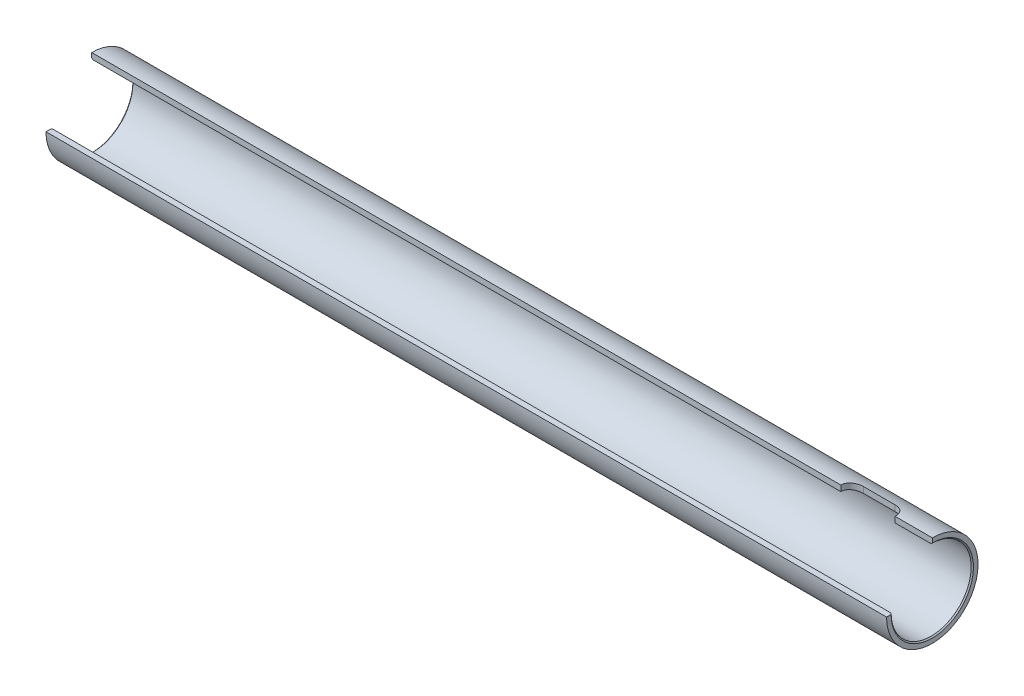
ISO-10303-21;
HEADER;
FILE_DESCRIPTION(('STEP AP214'),'2;1');
FILE_NAME('part.step','',(''),(''),'','','');
FILE_SCHEMA(('AUTOMOTIVE_DESIGN { 1 0 10303 214 1 1 1 1 }'));
ENDSEC;
DATA;
#1=APPLICATION_CONTEXT('core data for automotive mechanical design processes');
#2=APPLICATION_PROTOCOL_DEFINITION('international standard','automotive_design',2000,#1);
#3=PRODUCT_CONTEXT('',#1,'mechanical');
#4=PRODUCT('Part','Part','',(#3));
#5=PRODUCT_RELATED_PRODUCT_CATEGORY('part','',(#4));
#6=PRODUCT_DEFINITION_FORMATION('','',#4);
#7=PRODUCT_DEFINITION_CONTEXT('part definition',#1,'design');
#8=PRODUCT_DEFINITION('design','',#6,#7);
#9=PRODUCT_DEFINITION_SHAPE('','',#8);
#10=(LENGTH_UNIT() NAMED_UNIT(*) SI_UNIT(.MILLI.,.METRE.));
#11=(NAMED_UNIT(*) PLANE_ANGLE_UNIT() SI_UNIT($,.RADIAN.));
#12=(NAMED_UNIT(*) SI_UNIT($,.STERADIAN.) SOLID_ANGLE_UNIT());
#13=UNCERTAINTY_MEASURE_WITH_UNIT(LENGTH_MEASURE(1.E-05),#10,'distance_accuracy_value','');
#14=(GEOMETRIC_REPRESENTATION_CONTEXT(3) GLOBAL_UNCERTAINTY_ASSIGNED_CONTEXT((#13)) GLOBAL_UNIT_ASSIGNED_CONTEXT((#10,
#11,#12)) REPRESENTATION_CONTEXT('',''));
#15=CARTESIAN_POINT('',(0.,0.,0.));
#16=DIRECTION('',(0.,0.,1.));
#17=DIRECTION('',(1.,0.,0.));
#18=AXIS2_PLACEMENT_3D('',#15,#16,#17);
#19=CARTESIAN_POINT('',(-147.,0.,0.));
#20=DIRECTION('',(1.,0.,0.));
#21=DIRECTION('',(0.,0.,-1.));
#22=AXIS2_PLACEMENT_3D('',#19,#20,#21);
#23=CYLINDRICAL_SURFACE('',#22,8.);
#24=DIRECTION('',(1.,0.,0.));
#25=VECTOR('',#24,1.);
#26=CARTESIAN_POINT('',(-147.001,0.,8.));
#27=LINE('',#26,#25);
#28=CARTESIAN_POINT('',(-147.,0.,8.));
#29=VERTEX_POINT('',#28);
#30=CARTESIAN_POINT('',(0.,0.,8.));
#31=VERTEX_POINT('',#30);
#32=EDGE_CURVE('E201',#29,#31,#27,.T.);
#33=ORIENTED_EDGE('',*,*,#32,.F.);
#34=CARTESIAN_POINT('',(-147.,0.,0.));
#35=DIRECTION('',(1.,0.,0.));
#36=DIRECTION('',(0.,0.,-1.));
#37=AXIS2_PLACEMENT_3D('',#34,#35,#36);
#38=CIRCLE('',#37,8.);
#39=CARTESIAN_POINT('',(-147.,8.,0.));
#40=VERTEX_POINT('',#39);
#41=EDGE_CURVE('E185',#29,#40,#38,.T.);
#42=ORIENTED_EDGE('',*,*,#41,.T.);
#43=DIRECTION('',(1.,0.,0.));
#44=VECTOR('',#43,1.);
#45=CARTESIAN_POINT('',(-147.001,8.,0.));
#46=LINE('',#45,#44);
#47=CARTESIAN_POINT('',(-16.,8.,0.));
#48=VERTEX_POINT('',#47);
#49=EDGE_CURVE('E206',#40,#48,#46,.T.);
#50=ORIENTED_EDGE('',*,*,#49,.T.);
#51=CARTESIAN_POINT('',(-14.,7.74596669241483,-2.));
#52=CARTESIAN_POINT('',(-14.0553259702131,7.74596297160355,-2.00000067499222));
#53=CARTESIAN_POINT('',(-14.1106245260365,7.74656019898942,-1.99770281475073));
#54=CARTESIAN_POINT('',(-14.2208080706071,7.74891809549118,-1.98854259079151));
#55=CARTESIAN_POINT('',(-14.2756931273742,7.75067856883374,-1.98168099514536));
#56=CARTESIAN_POINT('',(-14.4389063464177,7.75763421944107,-1.95435047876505));
#57=CARTESIAN_POINT('',(-14.5461129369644,7.76450406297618,-1.92713539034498));
#58=CARTESIAN_POINT('',(-14.7542493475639,7.78190845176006,-1.85559615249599));
#59=CARTESIAN_POINT('',(-14.8551797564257,7.7924426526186,-1.81127361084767));
#60=CARTESIAN_POINT('',(-15.0482228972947,7.81598268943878,-1.70683075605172));
#61=CARTESIAN_POINT('',(-15.1403332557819,7.82898918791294,-1.64670620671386));
#62=CARTESIAN_POINT('',(-15.3150877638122,7.8563252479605,-1.51096894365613));
#63=CARTESIAN_POINT('',(-15.3975097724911,7.87067582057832,-1.43507453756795));
#64=CARTESIAN_POINT('',(-15.5486041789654,7.89890208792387,-1.27055156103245));
#65=CARTESIAN_POINT('',(-15.6172743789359,7.91277770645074,-1.18192095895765));
#66=CARTESIAN_POINT('',(-15.7398220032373,7.93872364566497,-0.992913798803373));
#67=CARTESIAN_POINT('',(-15.793479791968,7.95076609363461,-0.892390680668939));
#68=CARTESIAN_POINT('',(-15.8830494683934,7.97144692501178,-0.683405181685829));
#69=CARTESIAN_POINT('',(-15.9189648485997,7.98008597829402,-0.574944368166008));
#70=CARTESIAN_POINT('',(-15.9713179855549,7.99283800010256,-0.355488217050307));
#71=CARTESIAN_POINT('',(-15.9881353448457,7.99703905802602,-0.244588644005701));
#72=CARTESIAN_POINT('',(-16.0030067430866,8.00074876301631,-0.0214655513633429));
#73=CARTESIAN_POINT('',(-16.0010631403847,8.00025799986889,0.0907578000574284));
#74=CARTESIAN_POINT('',(-15.9787400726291,7.99470474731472,0.310704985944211));
#75=CARTESIAN_POINT('',(-15.9587707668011,7.98974397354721,0.418473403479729));
#76=CARTESIAN_POINT('',(-15.9016226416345,7.97592661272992,0.6290774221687));
#77=CARTESIAN_POINT('',(-15.8644430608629,7.96706985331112,0.731912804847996));
#78=CARTESIAN_POINT('',(-15.7735974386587,7.94629995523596,0.9308145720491));
#79=CARTESIAN_POINT('',(-15.7197852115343,7.93435987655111,1.02681125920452));
#80=CARTESIAN_POINT('',(-15.5973137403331,7.90871891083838,1.20855326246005));
#81=CARTESIAN_POINT('',(-15.5286522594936,7.89501775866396,1.2942970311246));
#82=CARTESIAN_POINT('',(-15.3762421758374,7.8669113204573,1.45553877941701));
#83=CARTESIAN_POINT('',(-15.2921367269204,7.8524970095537,1.53069820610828));
#84=CARTESIAN_POINT('',(-15.1123402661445,7.82492336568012,1.6659391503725));
#85=CARTESIAN_POINT('',(-15.0166460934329,7.81176437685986,1.72601654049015));
#86=CARTESIAN_POINT('',(-14.8157088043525,7.7881562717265,1.82960941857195));
#87=CARTESIAN_POINT('',(-14.7104170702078,7.77772212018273,1.87303403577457));
#88=CARTESIAN_POINT('',(-14.4937661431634,7.76094117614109,1.94140470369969));
#89=CARTESIAN_POINT('',(-14.3824162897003,7.7545882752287,1.96637837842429));
#90=CARTESIAN_POINT('',(-14.2250852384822,7.74910581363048,1.98780927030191));
#91=CARTESIAN_POINT('',(-14.1801605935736,7.74793046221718,1.99238158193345));
#92=CARTESIAN_POINT('',(-14.0901644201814,7.74636124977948,1.99847351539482));
#93=CARTESIAN_POINT('',(-14.0450932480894,7.74596612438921,1.99999807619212));
#94=CARTESIAN_POINT('',(-14.,7.74596669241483,2.00000000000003));
#95=B_SPLINE_CURVE_WITH_KNOTS('',3,(#51,#52,#53,#54,#55,#56,#57,#58,#59,#60,#61,#62,#63,#64,#65,
#66,#67,#68,#69,#70,#71,#72,#73,#74,#75,#76,#77,#78,#79,#80,#81,#82,#83,#84,#85,#86,#87,#88,#89,
#90,#91,#92,#93,#94),.UNSPECIFIED.,.F.,.F.,(4,2,2,2,2,2,2,2,2,2,2,2,2,2,2,2,2,2,2,2,2,4),(0.,
0.165873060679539,0.331718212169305,0.662459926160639,0.993170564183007,1.32396994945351,
1.66128379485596,1.9986515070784,2.34072374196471,2.68272861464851,3.01780963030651,
3.3528485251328,3.68045090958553,4.00806778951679,4.33865018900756,4.6692824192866,
5.00882859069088,5.34846758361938,5.68993440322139,6.03088895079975,6.166316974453,
6.30152535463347),.UNSPECIFIED.);
#96=CARTESIAN_POINT('',(-14.,7.74596669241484,-1.99999999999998));
#97=VERTEX_POINT('',#96);
#98=EDGE_CURVE('E163',#97,#48,#95,.T.);
#99=ORIENTED_EDGE('',*,*,#98,.F.);
#100=DIRECTION('',(1.,0.,0.));
#101=VECTOR('',#100,1.);
#102=CARTESIAN_POINT('',(-147.,7.74596669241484,-1.99999999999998));
#103=LINE('',#102,#101);
#104=CARTESIAN_POINT('',(-8.50000000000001,7.74596669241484,-1.99999999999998));
#105=VERTEX_POINT('',#104);
#106=EDGE_CURVE('E171',#105,#97,#103,.F.);
#107=ORIENTED_EDGE('',*,*,#106,.F.);
#108=CARTESIAN_POINT('',(-8.5,7.74596669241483,2.00000000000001));
#109=CARTESIAN_POINT('',(-8.44467402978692,7.74596297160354,2.00000067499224));
#110=CARTESIAN_POINT('',(-8.38937547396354,7.74656019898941,1.99770281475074));
#111=CARTESIAN_POINT('',(-8.27919192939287,7.74891809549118,1.98854259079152));
#112=CARTESIAN_POINT('',(-8.22430687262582,7.75067856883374,1.98168099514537));
#113=CARTESIAN_POINT('',(-8.06109365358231,7.75763421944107,1.95435047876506));
#114=CARTESIAN_POINT('',(-7.95388706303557,7.76450406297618,1.927135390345));
#115=CARTESIAN_POINT('',(-7.74575065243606,7.78190845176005,1.855596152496));
#116=CARTESIAN_POINT('',(-7.64482024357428,7.7924426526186,1.81127361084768));
#117=CARTESIAN_POINT('',(-7.45177710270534,7.81598268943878,1.70683075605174));
#118=CARTESIAN_POINT('',(-7.35966674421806,7.82898918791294,1.64670620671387));
#119=CARTESIAN_POINT('',(-7.18491223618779,7.8563252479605,1.51096894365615));
#120=CARTESIAN_POINT('',(-7.10249022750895,7.87067582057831,1.43507453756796));
#121=CARTESIAN_POINT('',(-6.95139582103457,7.89890208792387,1.27055156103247));
#122=CARTESIAN_POINT('',(-6.8827256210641,7.91277770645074,1.18192095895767));
#123=CARTESIAN_POINT('',(-6.7601779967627,7.93872364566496,0.992913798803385));
#124=CARTESIAN_POINT('',(-6.70652020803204,7.95076609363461,0.892390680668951));
#125=CARTESIAN_POINT('',(-6.61695053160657,7.97144692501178,0.68340518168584));
#126=CARTESIAN_POINT('',(-6.58103515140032,7.98008597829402,0.57494436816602));
#127=CARTESIAN_POINT('',(-6.52868201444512,7.99283800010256,0.355488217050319));
#128=CARTESIAN_POINT('',(-6.51186465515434,7.99703905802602,0.244588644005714));
#129=CARTESIAN_POINT('',(-6.49699325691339,8.00074876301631,0.0214655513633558));
#130=CARTESIAN_POINT('',(-6.49893685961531,8.00025799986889,-0.0907578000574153));
#131=CARTESIAN_POINT('',(-6.52125992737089,7.99470474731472,-0.310704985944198));
#132=CARTESIAN_POINT('',(-6.54122923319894,7.98974397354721,-0.418473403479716));
#133=CARTESIAN_POINT('',(-6.59837735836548,7.97592661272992,-0.629077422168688));
#134=CARTESIAN_POINT('',(-6.63555693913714,7.96706985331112,-0.731912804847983));
#135=CARTESIAN_POINT('',(-6.72640256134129,7.94629995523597,-0.930814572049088));
#136=CARTESIAN_POINT('',(-6.78021478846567,7.93435987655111,-1.02681125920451));
#137=CARTESIAN_POINT('',(-6.90268625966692,7.90871891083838,-1.20855326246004));
#138=CARTESIAN_POINT('',(-6.97134774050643,7.89501775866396,-1.29429703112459));
#139=CARTESIAN_POINT('',(-7.12375782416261,7.86691132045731,-1.45553877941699));
#140=CARTESIAN_POINT('',(-7.20786327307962,7.85249700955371,-1.53069820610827));
#141=CARTESIAN_POINT('',(-7.38765973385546,7.82492336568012,-1.66593915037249));
#142=CARTESIAN_POINT('',(-7.48335390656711,7.81176437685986,-1.72601654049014));
#143=CARTESIAN_POINT('',(-7.68429119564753,7.7881562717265,-1.82960941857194));
#144=CARTESIAN_POINT('',(-7.78958292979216,7.77772212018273,-1.87303403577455));
#145=CARTESIAN_POINT('',(-8.00623385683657,7.7609411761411,-1.94140470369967));
#146=CARTESIAN_POINT('',(-8.11758371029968,7.7545882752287,-1.96637837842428));
#147=CARTESIAN_POINT('',(-8.2749147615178,7.74910581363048,-1.98780927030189));
#148=CARTESIAN_POINT('',(-8.31983940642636,7.74793046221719,-1.99238158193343));
#149=CARTESIAN_POINT('',(-8.40983557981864,7.74636124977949,-1.9984735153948));
#150=CARTESIAN_POINT('',(-8.45490675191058,7.74596612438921,-1.99999807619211));
#151=CARTESIAN_POINT('',(-8.5,7.74596669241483,-2.00000000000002));
#152=B_SPLINE_CURVE_WITH_KNOTS('',3,(#108,#109,#110,#111,#112,#113,#114,#115,#116,#117,#118,
#119,#120,#121,#122,#123,#124,#125,#126,#127,#128,#129,#130,#131,#132,#133,#134,#135,#136,#137,
#138,#139,#140,#141,#142,#143,#144,#145,#146,#147,#148,#149,#150,#151),.UNSPECIFIED.,.F.,.F.,(4,
2,2,2,2,2,2,2,2,2,2,2,2,2,2,2,2,2,2,2,2,4),(0.,0.16587306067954,0.331718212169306,
0.662459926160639,0.993170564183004,1.32396994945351,1.66128379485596,1.9986515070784,
2.34072374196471,2.68272861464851,3.01780963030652,3.3528485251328,3.68045090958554,
4.00806778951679,4.33865018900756,4.66928241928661,5.00882859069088,5.34846758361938,
5.68993440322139,6.03088895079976,6.166316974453,6.30152535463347),.UNSPECIFIED.);
#153=CARTESIAN_POINT('',(-6.49999999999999,8.,0.));
#154=VERTEX_POINT('',#153);
#155=EDGE_CURVE('E170',#154,#105,#152,.T.);
#156=ORIENTED_EDGE('',*,*,#155,.F.);
#157=CARTESIAN_POINT('',(0.,8.,0.));
#158=VERTEX_POINT('',#157);
#159=EDGE_CURVE('E225',#154,#158,#46,.T.);
#160=ORIENTED_EDGE('',*,*,#159,.T.);
#161=CARTESIAN_POINT('',(0.,0.,0.));
#162=DIRECTION('',(1.,0.,0.));
#163=DIRECTION('',(0.,0.,-1.));
#164=AXIS2_PLACEMENT_3D('',#161,#162,#163);
#165=CIRCLE('',#164,8.);
#166=EDGE_CURVE('E189',#31,#158,#165,.T.);
#167=ORIENTED_EDGE('',*,*,#166,.F.);
#168=EDGE_LOOP('',(#33,#42,#50,#99,#107,#156,#160,#167));
#169=FACE_BOUND('',#168,.T.);
#170=ADVANCED_FACE('F33',(#169),#23,.T.);
#171=CARTESIAN_POINT('',(-147.,0.,0.));
#172=DIRECTION('',(1.,0.,0.));
#173=DIRECTION('',(0.,0.,-1.));
#174=AXIS2_PLACEMENT_3D('',#171,#172,#173);
#175=CYLINDRICAL_SURFACE('',#174,7.);
#176=CARTESIAN_POINT('',(-146.8,0.,0.));
#177=DIRECTION('',(1.,0.,0.));
#178=DIRECTION('',(0.,0.,-1.));
#179=AXIS2_PLACEMENT_3D('',#176,#177,#178);
#180=CIRCLE('',#179,7.);
#181=CARTESIAN_POINT('',(-146.8,7.,0.));
#182=VERTEX_POINT('',#181);
#183=CARTESIAN_POINT('',(-146.8,0.,7.));
#184=VERTEX_POINT('',#183);
#185=EDGE_CURVE('E41',#182,#184,#180,.F.);
#186=ORIENTED_EDGE('',*,*,#185,.T.);
#187=DIRECTION('',(1.,0.,0.));
#188=VECTOR('',#187,1.);
#189=CARTESIAN_POINT('',(-147.,0.,7.));
#190=LINE('',#189,#188);
#191=CARTESIAN_POINT('',(-0.200000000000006,0.,7.));
#192=VERTEX_POINT('',#191);
#193=EDGE_CURVE('E112',#192,#184,#190,.F.);
#194=ORIENTED_EDGE('',*,*,#193,.F.);
#195=CARTESIAN_POINT('',(-0.200000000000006,0.,0.));
#196=DIRECTION('',(1.,0.,0.));
#197=DIRECTION('',(0.,0.,-1.));
#198=AXIS2_PLACEMENT_3D('',#195,#196,#197);
#199=CIRCLE('',#198,7.);
#200=CARTESIAN_POINT('',(-0.200000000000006,7.,0.));
#201=VERTEX_POINT('',#200);
#202=EDGE_CURVE('E126',#192,#201,#199,.T.);
#203=ORIENTED_EDGE('',*,*,#202,.T.);
#204=DIRECTION('',(1.,0.,0.));
#205=VECTOR('',#204,1.);
#206=CARTESIAN_POINT('',(-147.,7.,0.));
#207=LINE('',#206,#205);
#208=CARTESIAN_POINT('',(-6.49999999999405,7.0000000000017,6.2615564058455E-13));
#209=VERTEX_POINT('',#208);
#210=EDGE_CURVE('E56',#209,#201,#207,.T.);
#211=ORIENTED_EDGE('',*,*,#210,.F.);
#212=CARTESIAN_POINT('',(-8.5,6.70820393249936,-2.00000000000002));
#213=CARTESIAN_POINT('',(-8.44496595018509,6.70819953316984,-2.00000099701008));
#214=CARTESIAN_POINT('',(-8.38995948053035,6.70888204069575,-1.99772698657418));
#215=CARTESIAN_POINT('',(-8.28036379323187,6.71157572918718,-1.98866401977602));
#216=CARTESIAN_POINT('',(-8.2257744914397,6.71358663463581,-1.98187599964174));
#217=CARTESIAN_POINT('',(-8.06349250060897,6.72152750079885,-1.95485062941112));
#218=CARTESIAN_POINT('',(-7.95692436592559,6.72936619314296,-1.92795143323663));
#219=CARTESIAN_POINT('',(-7.75005997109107,6.74920530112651,-1.85729763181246));
#220=CARTESIAN_POINT('',(-7.64976201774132,6.76120458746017,-1.8135476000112));
#221=CARTESIAN_POINT('',(-7.45786335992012,6.78800504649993,-1.71050096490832));
#222=CARTESIAN_POINT('',(-7.36626620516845,6.80280735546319,-1.65119805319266));
#223=CARTESIAN_POINT('',(-7.19180923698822,6.83401742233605,-1.51692637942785));
#224=CARTESIAN_POINT('',(-7.10923586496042,6.85045675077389,-1.44159286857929));
#225=CARTESIAN_POINT('',(-6.95770094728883,6.88281888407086,-1.27817556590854));
#226=CARTESIAN_POINT('',(-6.88874165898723,6.89874160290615,-1.1900896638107));
#227=CARTESIAN_POINT('',(-6.7651698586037,6.92863365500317,-1.00164390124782));
#228=CARTESIAN_POINT('',(-6.71084792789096,6.94256116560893,-0.901086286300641));
#229=CARTESIAN_POINT('',(-6.61999661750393,6.96652585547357,-0.691803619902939));
#230=CARTESIAN_POINT('',(-6.58346298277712,6.9765639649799,-0.583080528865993));
#231=CARTESIAN_POINT('',(-6.53016581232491,6.99139511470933,-0.363559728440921));
#232=CARTESIAN_POINT('',(-6.51291134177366,6.9963181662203,-0.252890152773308));
#233=CARTESIAN_POINT('',(-6.4971132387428,7.0008209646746,-0.0301224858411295));
#234=CARTESIAN_POINT('',(-6.4985664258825,7.00040161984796,0.0819753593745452));
#235=CARTESIAN_POINT('',(-6.51980642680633,6.99436005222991,0.300980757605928));
#236=CARTESIAN_POINT('',(-6.53906180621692,6.98888865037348,0.407944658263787));
#237=CARTESIAN_POINT('',(-6.59449548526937,6.97353876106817,0.617053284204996));
#238=CARTESIAN_POINT('',(-6.63067463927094,6.96366005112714,0.719197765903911));
#239=CARTESIAN_POINT('',(-6.7193097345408,6.94039022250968,0.917074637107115));
#240=CARTESIAN_POINT('',(-6.77193952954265,6.92696183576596,1.01272458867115));
#241=CARTESIAN_POINT('',(-6.89184578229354,6.89802743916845,1.19400864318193));
#242=CARTESIAN_POINT('',(-6.95912521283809,6.88252100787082,1.27964070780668));
#243=CARTESIAN_POINT('',(-7.10919759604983,6.85045847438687,1.44162429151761));
#244=CARTESIAN_POINT('',(-7.1924510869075,6.83388462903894,1.51754611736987));
#245=CARTESIAN_POINT('',(-7.37069729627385,6.8020328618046,1.65448071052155));
#246=CARTESIAN_POINT('',(-7.46569333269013,6.78675530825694,1.71548924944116));
#247=CARTESIAN_POINT('',(-7.66578722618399,6.75914312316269,1.82126577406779));
#248=CARTESIAN_POINT('',(-7.77096410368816,6.74683461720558,1.86589126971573));
#249=CARTESIAN_POINT('',(-7.98771206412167,6.72687625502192,1.93662306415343));
#250=CARTESIAN_POINT('',(-8.0992731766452,6.71921934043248,1.96275743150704));
#251=CARTESIAN_POINT('',(-8.25987946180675,6.71232934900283,1.98612021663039));
#252=CARTESIAN_POINT('',(-8.307779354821,6.71078540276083,1.99132502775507));
#253=CARTESIAN_POINT('',(-8.4037782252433,6.70872274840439,1.99826154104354));
#254=CARTESIAN_POINT('',(-8.45187678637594,6.70820247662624,1.9999985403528));
#255=CARTESIAN_POINT('',(-8.5,6.70820393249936,2.00000000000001));
#256=B_SPLINE_CURVE_WITH_KNOTS('',3,(#212,#213,#214,#215,#216,#217,#218,#219,#220,#221,#222,
#223,#224,#225,#226,#227,#228,#229,#230,#231,#232,#233,#234,#235,#236,#237,#238,#239,#240,#241,
#242,#243,#244,#245,#246,#247,#248,#249,#250,#251,#252,#253,#254,#255),.UNSPECIFIED.,.F.,.F.,(4,
2,2,2,2,2,2,2,2,2,2,2,2,2,2,2,2,2,2,2,2,4),(0.,0.164996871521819,0.329959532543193,
0.658815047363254,0.987581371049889,1.31648125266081,1.6538679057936,1.99131045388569,
2.33502692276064,2.67866113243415,3.01332990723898,3.34794178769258,3.67287650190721,
3.99782762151,4.32633613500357,4.65491137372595,4.99498620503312,5.33515734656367,
5.67822068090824,6.02076213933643,6.16526974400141,6.30955644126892),.UNSPECIFIED.);
#257=CARTESIAN_POINT('',(-8.5,6.70820393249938,-2.00000000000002));
#258=VERTEX_POINT('',#257);
#259=EDGE_CURVE('E143',#258,#209,#256,.T.);
#260=ORIENTED_EDGE('',*,*,#259,.F.);
#261=DIRECTION('',(1.,0.,0.));
#262=VECTOR('',#261,1.);
#263=CARTESIAN_POINT('',(-147.,6.70820393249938,-1.99999999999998));
#264=LINE('',#263,#262);
#265=CARTESIAN_POINT('',(-14.,6.70820393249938,-1.99999999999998));
#266=VERTEX_POINT('',#265);
#267=EDGE_CURVE('E188',#266,#258,#264,.T.);
#268=ORIENTED_EDGE('',*,*,#267,.F.);
#269=CARTESIAN_POINT('',(-14.,6.70820393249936,2.00000000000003));
#270=CARTESIAN_POINT('',(-14.0550340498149,6.70819953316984,2.00000099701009));
#271=CARTESIAN_POINT('',(-14.1100405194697,6.70888204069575,1.99772698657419));
#272=CARTESIAN_POINT('',(-14.2196362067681,6.71157572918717,1.98866401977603));
#273=CARTESIAN_POINT('',(-14.2742255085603,6.7135866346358,1.98187599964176));
#274=CARTESIAN_POINT('',(-14.436507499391,6.72152750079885,1.95485062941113));
#275=CARTESIAN_POINT('',(-14.5430756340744,6.72936619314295,1.92795143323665));
#276=CARTESIAN_POINT('',(-14.7499400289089,6.74920530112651,1.85729763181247));
#277=CARTESIAN_POINT('',(-14.8502379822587,6.76120458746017,1.81354760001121));
#278=CARTESIAN_POINT('',(-15.0421366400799,6.78800504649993,1.71050096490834));
#279=CARTESIAN_POINT('',(-15.1337337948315,6.80280735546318,1.65119805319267));
#280=CARTESIAN_POINT('',(-15.3081907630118,6.83401742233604,1.51692637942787));
#281=CARTESIAN_POINT('',(-15.3907641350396,6.85045675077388,1.4415928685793));
#282=CARTESIAN_POINT('',(-15.5422990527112,6.88281888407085,1.27817556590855));
#283=CARTESIAN_POINT('',(-15.6112583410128,6.89874160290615,1.19008966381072));
#284=CARTESIAN_POINT('',(-15.7348301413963,6.92863365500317,1.00164390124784));
#285=CARTESIAN_POINT('',(-15.789152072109,6.94256116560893,0.901086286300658));
#286=CARTESIAN_POINT('',(-15.8800033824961,6.96652585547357,0.691803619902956));
#287=CARTESIAN_POINT('',(-15.9165370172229,6.9765639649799,0.583080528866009));
#288=CARTESIAN_POINT('',(-15.9698341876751,6.99139511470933,0.363559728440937));
#289=CARTESIAN_POINT('',(-15.9870886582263,6.99631816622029,0.252890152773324));
#290=CARTESIAN_POINT('',(-16.0028867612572,7.0008209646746,0.0301224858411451));
#291=CARTESIAN_POINT('',(-16.0014335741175,7.00040161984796,-0.0819753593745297));
#292=CARTESIAN_POINT('',(-15.9801935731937,6.99436005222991,-0.300980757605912));
#293=CARTESIAN_POINT('',(-15.9609381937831,6.98888865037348,-0.407944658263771));
#294=CARTESIAN_POINT('',(-15.9055045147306,6.97353876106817,-0.61705328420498));
#295=CARTESIAN_POINT('',(-15.8693253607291,6.96366005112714,-0.719197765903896));
#296=CARTESIAN_POINT('',(-15.7806902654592,6.94039022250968,-0.9170746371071));
#297=CARTESIAN_POINT('',(-15.7280604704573,6.92696183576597,-1.01272458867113));
#298=CARTESIAN_POINT('',(-15.6081542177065,6.89802743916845,-1.19400864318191));
#299=CARTESIAN_POINT('',(-15.5408747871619,6.88252100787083,-1.27964070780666));
#300=CARTESIAN_POINT('',(-15.3908024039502,6.85045847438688,-1.4416242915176));
#301=CARTESIAN_POINT('',(-15.3075489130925,6.83388462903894,-1.51754611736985));
#302=CARTESIAN_POINT('',(-15.1293027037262,6.8020328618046,-1.65448071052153));
#303=CARTESIAN_POINT('',(-15.0343066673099,6.78675530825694,-1.71548924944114));
#304=CARTESIAN_POINT('',(-14.834212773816,6.75914312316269,-1.82126577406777));
#305=CARTESIAN_POINT('',(-14.7290358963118,6.74683461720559,-1.86589126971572));
#306=CARTESIAN_POINT('',(-14.5122879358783,6.72687625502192,-1.93662306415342));
#307=CARTESIAN_POINT('',(-14.4007268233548,6.71921934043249,-1.96275743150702));
#308=CARTESIAN_POINT('',(-14.2401205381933,6.71232934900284,-1.98612021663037));
#309=CARTESIAN_POINT('',(-14.192220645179,6.71078540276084,-1.99132502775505));
#310=CARTESIAN_POINT('',(-14.0962217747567,6.7087227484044,-1.99826154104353));
#311=CARTESIAN_POINT('',(-14.0481232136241,6.70820247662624,-1.99999854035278));
#312=CARTESIAN_POINT('',(-14.,6.70820393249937,-2.));
#313=B_SPLINE_CURVE_WITH_KNOTS('',3,(#269,#270,#271,#272,#273,#274,#275,#276,#277,#278,#279,
#280,#281,#282,#283,#284,#285,#286,#287,#288,#289,#290,#291,#292,#293,#294,#295,#296,#297,#298,
#299,#300,#301,#302,#303,#304,#305,#306,#307,#308,#309,#310,#311,#312),.UNSPECIFIED.,.F.,.F.,(4,
2,2,2,2,2,2,2,2,2,2,2,2,2,2,2,2,2,2,2,2,4),(0.,0.16499687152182,0.329959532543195,
0.658815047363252,0.987581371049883,1.31648125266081,1.65386790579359,1.99131045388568,
2.33502692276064,2.67866113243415,3.01332990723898,3.34794178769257,3.67287650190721,
3.99782762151,4.32633613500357,4.65491137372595,4.99498620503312,5.33515734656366,
5.67822068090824,6.02076213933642,6.16526974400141,6.30955644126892),.UNSPECIFIED.);
#314=CARTESIAN_POINT('',(-16.000000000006,7.0000000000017,-6.26155643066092E-13));
#315=VERTEX_POINT('',#314);
#316=EDGE_CURVE('E134',#315,#266,#313,.T.);
#317=ORIENTED_EDGE('',*,*,#316,.F.);
#318=EDGE_CURVE('E203',#182,#315,#207,.T.);
#319=ORIENTED_EDGE('',*,*,#318,.F.);
#320=EDGE_LOOP('',(#186,#194,#203,#211,#260,#268,#317,#319));
#321=FACE_BOUND('',#320,.T.);
#322=ADVANCED_FACE('F125',(#321),#175,.F.);
#323=CARTESIAN_POINT('',(-147.,0.,0.));
#324=DIRECTION('',(1.,0.,0.));
#325=DIRECTION('',(0.,0.,-1.));
#326=AXIS2_PLACEMENT_3D('',#323,#324,#325);
#327=PLANE('',#326);
#328=ORIENTED_EDGE('',*,*,#41,.F.);
#329=DIRECTION('',(0.,0.,1.));
#330=VECTOR('',#329,1.);
#331=CARTESIAN_POINT('',(-147.,0.,0.));
#332=LINE('',#331,#330);
#333=CARTESIAN_POINT('',(-147.,0.,7.20000000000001));
#334=VERTEX_POINT('',#333);
#335=EDGE_CURVE('E129',#334,#29,#332,.T.);
#336=ORIENTED_EDGE('',*,*,#335,.F.);
#337=CARTESIAN_POINT('',(-147.,0.,0.));
#338=DIRECTION('',(1.,0.,0.));
#339=DIRECTION('',(0.,0.,-1.));
#340=AXIS2_PLACEMENT_3D('',#337,#338,#339);
#341=CIRCLE('',#340,7.20000000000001);
#342=CARTESIAN_POINT('',(-147.,7.20000000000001,0.));
#343=VERTEX_POINT('',#342);
#344=EDGE_CURVE('E131',#334,#343,#341,.T.);
#345=ORIENTED_EDGE('',*,*,#344,.T.);
#346=DIRECTION('',(0.,-1.,0.));
#347=VECTOR('',#346,1.);
#348=CARTESIAN_POINT('',(-147.,0.,0.));
#349=LINE('',#348,#347);
#350=EDGE_CURVE('E48',#40,#343,#349,.T.);
#351=ORIENTED_EDGE('',*,*,#350,.F.);
#352=EDGE_LOOP('',(#328,#336,#345,#351));
#353=FACE_BOUND('',#352,.T.);
#354=ADVANCED_FACE('F218',(#353),#327,.F.);
#355=CARTESIAN_POINT('',(0.,0.,0.));
#356=DIRECTION('',(1.,0.,0.));
#357=DIRECTION('',(0.,0.,-1.));
#358=AXIS2_PLACEMENT_3D('',#355,#356,#357);
#359=PLANE('',#358);
#360=DIRECTION('',(0.,0.,-1.));
#361=VECTOR('',#360,1.);
#362=CARTESIAN_POINT('',(0.,0.,0.));
#363=LINE('',#362,#361);
#364=CARTESIAN_POINT('',(0.,0.,7.2));
#365=VERTEX_POINT('',#364);
#366=EDGE_CURVE('E115',#31,#365,#363,.T.);
#367=ORIENTED_EDGE('',*,*,#366,.F.);
#368=ORIENTED_EDGE('',*,*,#166,.T.);
#369=DIRECTION('',(0.,1.,0.));
#370=VECTOR('',#369,1.);
#371=CARTESIAN_POINT('',(0.,0.,0.));
#372=LINE('',#371,#370);
#373=CARTESIAN_POINT('',(0.,7.2,0.));
#374=VERTEX_POINT('',#373);
#375=EDGE_CURVE('E224',#374,#158,#372,.T.);
#376=ORIENTED_EDGE('',*,*,#375,.F.);
#377=CARTESIAN_POINT('',(0.,0.,0.));
#378=DIRECTION('',(1.,0.,0.));
#379=DIRECTION('',(0.,0.,-1.));
#380=AXIS2_PLACEMENT_3D('',#377,#378,#379);
#381=CIRCLE('',#380,7.2);
#382=EDGE_CURVE('E11',#374,#365,#381,.F.);
#383=ORIENTED_EDGE('',*,*,#382,.T.);
#384=EDGE_LOOP('',(#367,#368,#376,#383));
#385=FACE_BOUND('',#384,.T.);
#386=ADVANCED_FACE('F156',(#385),#359,.T.);
#387=CARTESIAN_POINT('',(-14.,8.001,0.));
#388=DIRECTION('',(0.,-1.,0.));
#389=DIRECTION('',(0.,0.,-1.));
#390=AXIS2_PLACEMENT_3D('',#387,#388,#389);
#391=CYLINDRICAL_SURFACE('',#390,2.00000000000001);
#392=DIRECTION('',(0.,-1.,0.));
#393=VECTOR('',#392,1.);
#394=CARTESIAN_POINT('',(-16.,8.001,0.));
#395=LINE('',#394,#393);
#396=EDGE_CURVE('E184',#48,#315,#395,.T.);
#397=ORIENTED_EDGE('',*,*,#396,.T.);
#398=ORIENTED_EDGE('',*,*,#316,.T.);
#399=DIRECTION('',(0.,-1.,0.));
#400=VECTOR('',#399,1.);
#401=CARTESIAN_POINT('',(-14.,8.001,-2.00000000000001));
#402=LINE('',#401,#400);
#403=EDGE_CURVE('E181',#97,#266,#402,.T.);
#404=ORIENTED_EDGE('',*,*,#403,.F.);
#405=ORIENTED_EDGE('',*,*,#98,.T.);
#406=EDGE_LOOP('',(#397,#398,#404,#405));
#407=FACE_BOUND('',#406,.T.);
#408=ADVANCED_FACE('F152',(#407),#391,.F.);
#409=CARTESIAN_POINT('',(-8.5,8.001,0.));
#410=DIRECTION('',(0.,-1.,0.));
#411=DIRECTION('',(0.,0.,-1.));
#412=AXIS2_PLACEMENT_3D('',#409,#410,#411);
#413=CYLINDRICAL_SURFACE('',#412,2.00000000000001);
#414=DIRECTION('',(0.,-1.,0.));
#415=VECTOR('',#414,1.);
#416=CARTESIAN_POINT('',(-6.49999999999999,8.001,0.));
#417=LINE('',#416,#415);
#418=EDGE_CURVE('E198',#209,#154,#417,.F.);
#419=ORIENTED_EDGE('',*,*,#418,.T.);
#420=ORIENTED_EDGE('',*,*,#155,.T.);
#421=DIRECTION('',(0.,-1.,0.));
#422=VECTOR('',#421,1.);
#423=CARTESIAN_POINT('',(-8.5,8.001,-2.00000000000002));
#424=LINE('',#423,#422);
#425=EDGE_CURVE('E178',#105,#258,#424,.T.);
#426=ORIENTED_EDGE('',*,*,#425,.T.);
#427=ORIENTED_EDGE('',*,*,#259,.T.);
#428=EDGE_LOOP('',(#419,#420,#426,#427));
#429=FACE_BOUND('',#428,.T.);
#430=ADVANCED_FACE('F155',(#429),#413,.F.);
#431=CARTESIAN_POINT('',(-14.,8.001,-2.00000000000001));
#432=DIRECTION('',(0.,0.,1.));
#433=DIRECTION('',(1.,0.,0.));
#434=AXIS2_PLACEMENT_3D('',#431,#432,#433);
#435=PLANE('',#434);
#436=ORIENTED_EDGE('',*,*,#267,.T.);
#437=ORIENTED_EDGE('',*,*,#425,.F.);
#438=ORIENTED_EDGE('',*,*,#106,.T.);
#439=ORIENTED_EDGE('',*,*,#403,.T.);
#440=EDGE_LOOP('',(#436,#437,#438,#439));
#441=FACE_BOUND('',#440,.T.);
#442=ADVANCED_FACE('F232',(#441),#435,.T.);
#443=CARTESIAN_POINT('',(-147.,0.,0.));
#444=DIRECTION('',(-1.,0.,0.));
#445=DIRECTION('',(0.,0.,1.));
#446=AXIS2_PLACEMENT_3D('',#443,#444,#445);
#447=CONICAL_SURFACE('',#446,7.20000000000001,0.785398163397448);
#448=DIRECTION('',(-0.707106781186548,0.,0.707106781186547));
#449=VECTOR('',#448,1.);
#450=CARTESIAN_POINT('',(-139.8,0.,0.));
#451=LINE('',#450,#449);
#452=EDGE_CURVE('E119',#334,#184,#451,.F.);
#453=ORIENTED_EDGE('',*,*,#452,.T.);
#454=ORIENTED_EDGE('',*,*,#185,.F.);
#455=DIRECTION('',(0.707106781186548,-0.707106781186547,0.));
#456=VECTOR('',#455,1.);
#457=CARTESIAN_POINT('',(-139.8,0.,0.));
#458=LINE('',#457,#456);
#459=EDGE_CURVE('E204',#182,#343,#458,.F.);
#460=ORIENTED_EDGE('',*,*,#459,.T.);
#461=ORIENTED_EDGE('',*,*,#344,.F.);
#462=EDGE_LOOP('',(#453,#454,#460,#461));
#463=FACE_BOUND('',#462,.T.);
#464=ADVANCED_FACE('F214',(#463),#447,.F.);
#465=CARTESIAN_POINT('',(-0.200000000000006,0.,0.));
#466=DIRECTION('',(1.,0.,0.));
#467=DIRECTION('',(0.,0.,-1.));
#468=AXIS2_PLACEMENT_3D('',#465,#466,#467);
#469=CONICAL_SURFACE('',#468,7.,0.785398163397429);
#470=DIRECTION('',(-0.707106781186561,0.,-0.707106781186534));
#471=VECTOR('',#470,1.);
#472=CARTESIAN_POINT('',(-7.20000000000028,0.,0.));
#473=LINE('',#472,#471);
#474=EDGE_CURVE('E109',#192,#365,#473,.F.);
#475=ORIENTED_EDGE('',*,*,#474,.T.);
#476=ORIENTED_EDGE('',*,*,#382,.F.);
#477=DIRECTION('',(0.707106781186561,0.707106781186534,0.));
#478=VECTOR('',#477,1.);
#479=CARTESIAN_POINT('',(-7.20000000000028,0.,0.));
#480=LINE('',#479,#478);
#481=EDGE_CURVE('E120',#374,#201,#480,.F.);
#482=ORIENTED_EDGE('',*,*,#481,.T.);
#483=ORIENTED_EDGE('',*,*,#202,.F.);
#484=EDGE_LOOP('',(#475,#476,#482,#483));
#485=FACE_BOUND('',#484,.T.);
#486=ADVANCED_FACE('F35',(#485),#469,.F.);
#487=CARTESIAN_POINT('',(-147.001,0.,0.));
#488=DIRECTION('',(0.,0.,-1.));
#489=DIRECTION('',(-1.,0.,0.));
#490=AXIS2_PLACEMENT_3D('',#487,#488,#489);
#491=PLANE('',#490);
#492=ORIENTED_EDGE('',*,*,#210,.T.);
#493=ORIENTED_EDGE('',*,*,#481,.F.);
#494=ORIENTED_EDGE('',*,*,#375,.T.);
#495=ORIENTED_EDGE('',*,*,#159,.F.);
#496=ORIENTED_EDGE('',*,*,#418,.F.);
#497=EDGE_LOOP('',(#492,#493,#494,#495,#496));
#498=FACE_BOUND('',#497,.T.);
#499=ADVANCED_FACE('F280',(#498),#491,.F.);
#500=CARTESIAN_POINT('',(-147.001,0.,0.));
#501=DIRECTION('',(0.,-1.,0.));
#502=DIRECTION('',(0.,0.,-1.));
#503=AXIS2_PLACEMENT_3D('',#500,#501,#502);
#504=PLANE('',#503);
#505=ORIENTED_EDGE('',*,*,#335,.T.);
#506=ORIENTED_EDGE('',*,*,#32,.T.);
#507=ORIENTED_EDGE('',*,*,#366,.T.);
#508=ORIENTED_EDGE('',*,*,#474,.F.);
#509=ORIENTED_EDGE('',*,*,#193,.T.);
#510=ORIENTED_EDGE('',*,*,#452,.F.);
#511=EDGE_LOOP('',(#505,#506,#507,#508,#509,#510));
#512=FACE_BOUND('',#511,.T.);
#513=ADVANCED_FACE('F111',(#512),#504,.F.);
#514=ORIENTED_EDGE('',*,*,#49,.F.);
#515=ORIENTED_EDGE('',*,*,#350,.T.);
#516=ORIENTED_EDGE('',*,*,#459,.F.);
#517=ORIENTED_EDGE('',*,*,#318,.T.);
#518=ORIENTED_EDGE('',*,*,#396,.F.);
#519=EDGE_LOOP('',(#514,#515,#516,#517,#518));
#520=FACE_BOUND('',#519,.T.);
#521=ADVANCED_FACE('F289',(#520),#491,.F.);
#522=CLOSED_SHELL('',(#170,#322,#354,#386,#408,#430,#442,#464,#486,#499,#513,#521));
#523=MANIFOLD_SOLID_BREP('B2',#522);
#524=ADVANCED_BREP_SHAPE_REPRESENTATION('',(#18,#523),#14);
#525=SHAPE_DEFINITION_REPRESENTATION(#9,#524);
ENDSEC;
END-ISO-10303-21;
